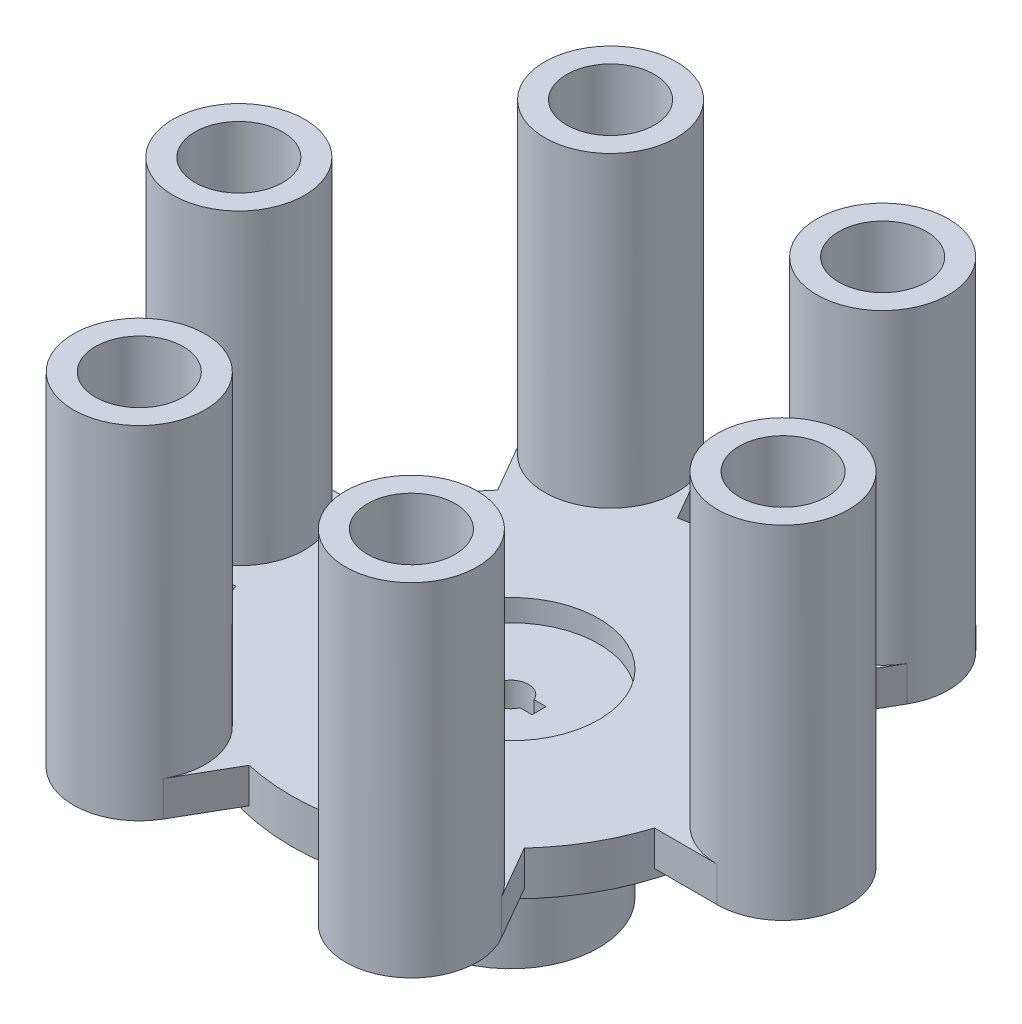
from build123d import *

# Parameters (mm, degrees)
SKETCH_1_R               = 10
SKETCH_1_R_2             = 2
EXTRUDE_1_DEPTH          = 10
SKETCH_2_W               = 1.602111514
SKETCH_2_H               = 1.6
CUT_EXTRUDE_1_DEPTH      = 30
SKETCH_3_R               = 25
SKETCH_3_R_2             = 10
EXTRUDE_2_DEPTH          = 2.5
EXTRUDE_3_DEPTH          = 4
SKETCH_5_R               = 5
CUT_EXTRUDE_2_DEPTH      = 8
EXTRUDE_START            = 35
SKETCH_6_R               = 5
EXTRUDE_4_DEPTH          = 35
PATTERN_CIRCULAR_1_COUNT = 6


with BuildPart() as part:
    # Sketch 1 → Extrude 1 (new, symmetric)
    with BuildSketch(Plane(origin=(0, 0, 0), x_dir=(1, 0, 0), z_dir=(0, 1, 0))):
        with Locations(Location((0, 0, 0), (0, 0, 270))):
            Circle(SKETCH_1_R)
        with Locations(Location((0, 0, 0), (0, 0, 270))):
            Circle(SKETCH_1_R_2, mode=Mode.SUBTRACT)
    extrude(amount=EXTRUDE_1_DEPTH, both=True)

    # Sketch 2 → Cut-Extrude 1 (cut)
    with BuildSketch(Plane(origin=(0, 10, 0), x_dir=(1, 0, 0), z_dir=(0, 1, 0))):
        with Locations((2.398944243, 0)):
            Rectangle(SKETCH_2_W, SKETCH_2_H)
    extrude(amount=-CUT_EXTRUDE_1_DEPTH, mode=Mode.SUBTRACT)

    # Sketch 3 → Extrude 2 (add, symmetric)
    with BuildSketch(Plane(origin=(0, 10, 0), x_dir=(1, 0, 0), z_dir=(0, 1, 0))):
        with Locations(Location((0, 0, 0), (0, 0, 270))):
            Circle(SKETCH_3_R)
        with Locations(Location((0, 0, 0), (0, 0, 270))):
            Circle(SKETCH_3_R_2, mode=Mode.SUBTRACT)
    extrude(amount=EXTRUDE_2_DEPTH, both=True)

    # Sketch 4 → Extrude 3 (add)
    with BuildSketch(Plane(origin=(0, 12.5, 0), x_dir=(1, 0, 0), z_dir=(0, 1, 0))):
        with BuildLine():
            Line((31, 7.5), (19.369908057, 7.5))
            Line((19.369908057, 7.5), (19.369908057, -7.5))
            Line((19.369908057, -7.5), (31, -7.5))
            ThreePointArc((31, -7.5), (38.5, 0), (31, 7.5))
        make_face()
        with BuildLine():
            Line((9.004809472, -30.596787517), (3.1897635, -20.524832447))
            Line((3.1897635, -20.524832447), (16.180144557, -13.024832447))
            Line((16.180144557, -13.024832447), (21.995190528, -23.096787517))
            ThreePointArc((21.995190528, -23.096787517), (19.25, -33.341978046), (9.004809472, -30.596787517))
        make_face()
        with BuildLine():
            Line((-21.995190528, -23.096787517), (-16.180144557, -13.024832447))
            Line((-16.180144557, -13.024832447), (-3.1897635, -20.524832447))
            Line((-3.1897635, -20.524832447), (-9.004809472, -30.596787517))
            ThreePointArc((-9.004809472, -30.596787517), (-19.25, -33.341978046), (-21.995190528, -23.096787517))
        make_face()
        with BuildLine():
            Line((-31, 7.5), (-19.369908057, 7.5))
            Line((-19.369908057, 7.5), (-19.369908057, -7.5))
            Line((-19.369908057, -7.5), (-31, -7.5))
            ThreePointArc((-31, -7.5), (-38.5, 0), (-31, 7.5))
        make_face()
        with BuildLine():
            Line((-9.004809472, 30.596787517), (-3.1897635, 20.524832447))
            Line((-3.1897635, 20.524832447), (-16.180144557, 13.024832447))
            Line((-16.180144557, 13.024832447), (-21.995190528, 23.096787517))
            ThreePointArc((-21.995190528, 23.096787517), (-19.25, 33.341978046), (-9.004809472, 30.596787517))
        make_face()
        with BuildLine():
            Line((21.995190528, 23.096787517), (16.180144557, 13.024832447))
            Line((16.180144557, 13.024832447), (3.1897635, 20.524832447))
            Line((3.1897635, 20.524832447), (9.004809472, 30.596787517))
            ThreePointArc((9.004809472, 30.596787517), (19.25, 33.341978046), (21.995190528, 23.096787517))
        make_face()
    extrude(amount=-EXTRUDE_3_DEPTH)

    # Sketch 5 → Cut-Extrude 2 (cut)
    with BuildSketch(Plane(origin=(0, 12.5, 0), x_dir=(1, 0, 0), z_dir=(0, 1, 0))):
        with Locations(Location((15.5, -26.846787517, 0), (0, 0, 270))):
            Circle(SKETCH_5_R)
        with Locations(Location((-15.5, -26.846787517, 0), (0, 0, 270))):
            Circle(SKETCH_5_R)
        with Locations(Location((-31, 0, 0), (0, 0, 270))):
            Circle(SKETCH_5_R)
        with Locations(Location((-15.5, 26.846787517, 0), (0, 0, 270))):
            Circle(SKETCH_5_R)
        with Locations(Location((15.5, 26.846787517, 0), (0, 0, 270))):
            Circle(SKETCH_5_R)
        with Locations(Location((31, 0, 0), (0, 0, 270))):
            Circle(SKETCH_5_R)
    extrude(amount=-CUT_EXTRUDE_2_DEPTH, mode=Mode.SUBTRACT)

    # Sketch 6 → Extrude 4 (add)
    with BuildSketch(Plane(origin=(0, 12.5, 0), x_dir=(1, 0, 0), z_dir=(0, 1, 0)).offset(EXTRUDE_START)):
        with BuildLine():
            ThreePointArc((-21.995190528, -23.096787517), (-19.25, -33.341978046), (-9.004809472, -30.596787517))
            ThreePointArc((-9.004809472, -30.596787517), (-8.255556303, -28.787930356), (-8, -26.846787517))
            ThreePointArc((-8, -26.846787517), (-13.558857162, -19.60234382), (-21.995190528, -23.096787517))
        make_face()
        with Locations(Location((-15.5, -26.846787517, 0), (0, 0, 270))):
            Circle(SKETCH_6_R, mode=Mode.SUBTRACT)
    extrude_4 = extrude(amount=-EXTRUDE_4_DEPTH)

    # Pattern Circular 1: Extrude 4 ×6 about axis
    pattern_circular_1_axis = Axis((0, 0, 0), (0, 1, 0))
    for i in range(1, PATTERN_CIRCULAR_1_COUNT):
        add(extrude_4.rotate(pattern_circular_1_axis, i * 360 / PATTERN_CIRCULAR_1_COUNT))


solid = part.part
